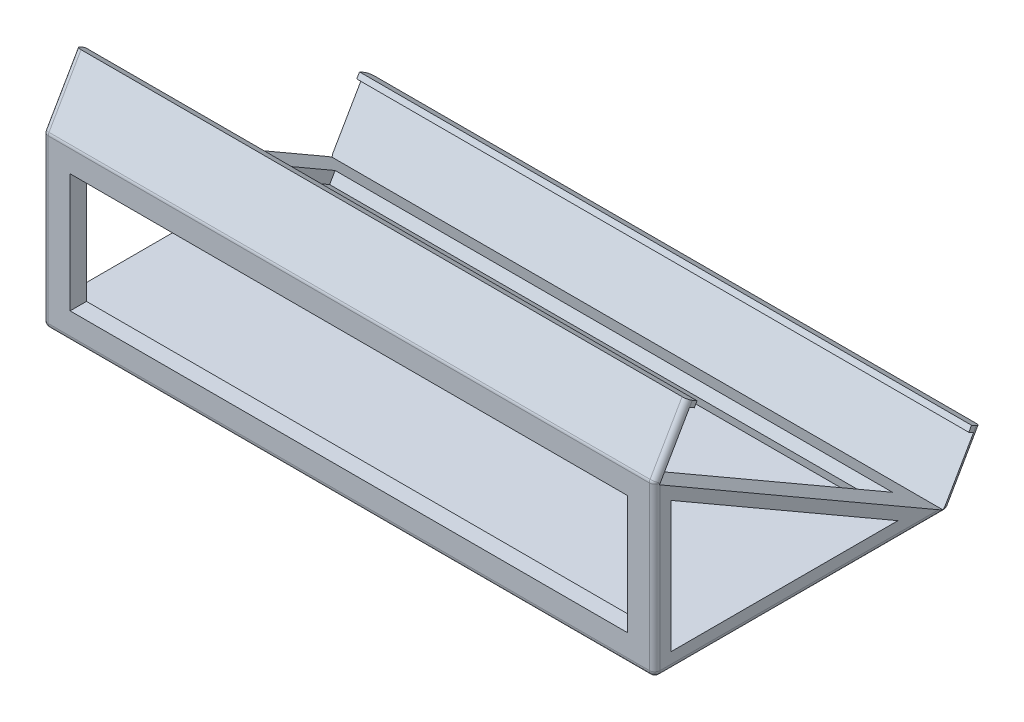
ISO-10303-21;
HEADER;
FILE_DESCRIPTION(('STEP AP214'),'2;1');
FILE_NAME('part.step','',(''),(''),'','','');
FILE_SCHEMA(('AUTOMOTIVE_DESIGN { 1 0 10303 214 1 1 1 1 }'));
ENDSEC;
DATA;
#1=APPLICATION_CONTEXT('core data for automotive mechanical design processes');
#2=APPLICATION_PROTOCOL_DEFINITION('international standard','automotive_design',2000,#1);
#3=PRODUCT_CONTEXT('',#1,'mechanical');
#4=PRODUCT('Part','Part','',(#3));
#5=PRODUCT_RELATED_PRODUCT_CATEGORY('part','',(#4));
#6=PRODUCT_DEFINITION_FORMATION('','',#4);
#7=PRODUCT_DEFINITION_CONTEXT('part definition',#1,'design');
#8=PRODUCT_DEFINITION('design','',#6,#7);
#9=PRODUCT_DEFINITION_SHAPE('','',#8);
#10=(LENGTH_UNIT() NAMED_UNIT(*) SI_UNIT(.MILLI.,.METRE.));
#11=(NAMED_UNIT(*) PLANE_ANGLE_UNIT() SI_UNIT($,.RADIAN.));
#12=(NAMED_UNIT(*) SI_UNIT($,.STERADIAN.) SOLID_ANGLE_UNIT());
#13=UNCERTAINTY_MEASURE_WITH_UNIT(LENGTH_MEASURE(1.E-05),#10,'distance_accuracy_value','');
#14=(GEOMETRIC_REPRESENTATION_CONTEXT(3) GLOBAL_UNCERTAINTY_ASSIGNED_CONTEXT((#13)) GLOBAL_UNIT_ASSIGNED_CONTEXT((#10,
#11,#12)) REPRESENTATION_CONTEXT('',''));
#15=CARTESIAN_POINT('',(0.,0.,0.));
#16=DIRECTION('',(0.,0.,1.));
#17=DIRECTION('',(1.,0.,0.));
#18=AXIS2_PLACEMENT_3D('',#15,#16,#17);
#19=CARTESIAN_POINT('',(112.,0.,0.));
#20=DIRECTION('',(1.,0.,0.));
#21=DIRECTION('',(0.,0.,-1.));
#22=AXIS2_PLACEMENT_3D('',#19,#20,#21);
#23=PLANE('',#22);
#24=DIRECTION('',(0.,-0.500000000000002,-0.866025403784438));
#25=VECTOR('',#24,1.);
#26=CARTESIAN_POINT('',(112.,41.3923048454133,47.6935750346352));
#27=LINE('',#26,#25);
#28=CARTESIAN_POINT('',(112.,40.8923048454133,46.8275496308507));
#29=VERTEX_POINT('',#28);
#30=CARTESIAN_POINT('',(112.,40.3923048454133,45.9615242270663));
#31=VERTEX_POINT('',#30);
#32=EDGE_CURVE('E404',#29,#31,#27,.T.);
#33=ORIENTED_EDGE('',*,*,#32,.F.);
#34=DIRECTION('',(0.,-0.866025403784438,0.500000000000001));
#35=VECTOR('',#34,1.);
#36=CARTESIAN_POINT('',(112.,30.5000000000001,52.8275496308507));
#37=LINE('',#36,#35);
#38=CARTESIAN_POINT('',(112.,40.0262794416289,47.3275496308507));
#39=VERTEX_POINT('',#38);
#40=EDGE_CURVE('E456',#29,#39,#37,.T.);
#41=ORIENTED_EDGE('',*,*,#40,.T.);
#42=DIRECTION('',(0.,0.500000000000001,0.866025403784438));
#43=VECTOR('',#42,1.);
#44=CARTESIAN_POINT('',(112.,39.5262794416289,46.4615242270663));
#45=LINE('',#44,#43);
#46=CARTESIAN_POINT('',(112.,39.5262794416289,46.4615242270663));
#47=VERTEX_POINT('',#46);
#48=EDGE_CURVE('E391',#47,#39,#45,.T.);
#49=ORIENTED_EDGE('',*,*,#48,.F.);
#50=DIRECTION('',(0.,-0.866025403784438,0.500000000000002));
#51=VECTOR('',#50,1.);
#52=CARTESIAN_POINT('',(112.,40.3923048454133,45.9615242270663));
#53=LINE('',#52,#51);
#54=EDGE_CURVE('E375',#31,#47,#53,.T.);
#55=ORIENTED_EDGE('',*,*,#54,.F.);
#56=EDGE_LOOP('',(#33,#41,#49,#55));
#57=FACE_BOUND('',#56,.T.);
#58=ADVANCED_FACE('F35',(#57),#23,.T.);
#59=DIRECTION('',(0.,-0.500000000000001,-0.866025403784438));
#60=VECTOR('',#59,1.);
#61=CARTESIAN_POINT('',(112.,10.5262794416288,-3.76794919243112));
#62=LINE('',#61,#60);
#63=CARTESIAN_POINT('',(112.,10.5262794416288,-3.76794919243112));
#64=VERTEX_POINT('',#63);
#65=CARTESIAN_POINT('',(112.,10.0262794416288,-4.63397459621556));
#66=VERTEX_POINT('',#65);
#67=EDGE_CURVE('E366',#64,#66,#62,.T.);
#68=ORIENTED_EDGE('',*,*,#67,.T.);
#69=DIRECTION('',(0.,-0.866025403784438,0.500000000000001));
#70=VECTOR('',#69,1.);
#71=CARTESIAN_POINT('',(112.,0.500000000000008,0.86602540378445));
#72=LINE('',#71,#70);
#73=CARTESIAN_POINT('',(112.,10.8923048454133,-5.13397459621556));
#74=VERTEX_POINT('',#73);
#75=EDGE_CURVE('E454',#66,#74,#72,.F.);
#76=ORIENTED_EDGE('',*,*,#75,.T.);
#77=DIRECTION('',(0.,0.500000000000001,0.866025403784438));
#78=VECTOR('',#77,1.);
#79=CARTESIAN_POINT('',(112.,10.3923048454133,-6.));
#80=LINE('',#79,#78);
#81=CARTESIAN_POINT('',(112.,11.3923048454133,-4.26794919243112));
#82=VERTEX_POINT('',#81);
#83=EDGE_CURVE('E410',#74,#82,#80,.T.);
#84=ORIENTED_EDGE('',*,*,#83,.T.);
#85=DIRECTION('',(0.,0.866025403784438,-0.500000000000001));
#86=VECTOR('',#85,1.);
#87=CARTESIAN_POINT('',(112.,11.3923048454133,-4.26794919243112));
#88=LINE('',#87,#86);
#89=EDGE_CURVE('E360',#64,#82,#88,.T.);
#90=ORIENTED_EDGE('',*,*,#89,.F.);
#91=EDGE_LOOP('',(#68,#76,#84,#90));
#92=FACE_BOUND('',#91,.T.);
#93=ADVANCED_FACE('F665',(#92),#23,.T.);
#94=CARTESIAN_POINT('',(0.,0.,0.));
#95=DIRECTION('',(1.,0.,0.));
#96=DIRECTION('',(0.,0.,-1.));
#97=AXIS2_PLACEMENT_3D('',#94,#95,#96);
#98=PLANE('',#97);
#99=DIRECTION('',(0.,0.,1.));
#100=VECTOR('',#99,1.);
#101=CARTESIAN_POINT('',(0.,3.,9.19615242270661));
#102=LINE('',#101,#100);
#103=CARTESIAN_POINT('',(0.,3.,9.19615242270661));
#104=VERTEX_POINT('',#103);
#105=CARTESIAN_POINT('',(0.,2.99999999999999,50.6935750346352));
#106=VERTEX_POINT('',#105);
#107=EDGE_CURVE('E340',#104,#106,#102,.T.);
#108=ORIENTED_EDGE('',*,*,#107,.F.);
#109=DIRECTION('',(0.,-0.500000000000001,-0.866025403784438));
#110=VECTOR('',#109,1.);
#111=CARTESIAN_POINT('',(0.,26.9585481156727,50.6935750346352));
#112=LINE('',#111,#110);
#113=CARTESIAN_POINT('',(0.,26.9585481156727,50.6935750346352));
#114=VERTEX_POINT('',#113);
#115=EDGE_CURVE('E326',#114,#104,#112,.T.);
#116=ORIENTED_EDGE('',*,*,#115,.F.);
#117=DIRECTION('',(0.,1.,0.));
#118=VECTOR('',#117,1.);
#119=CARTESIAN_POINT('',(0.,2.99999999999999,50.6935750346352));
#120=LINE('',#119,#118);
#121=EDGE_CURVE('E331',#106,#114,#120,.T.);
#122=ORIENTED_EDGE('',*,*,#121,.F.);
#123=EDGE_LOOP('',(#108,#116,#122));
#124=FACE_BOUND('',#123,.T.);
#125=DIRECTION('',(0.,0.,-1.));
#126=VECTOR('',#125,1.);
#127=CARTESIAN_POINT('',(0.,1.,0.));
#128=LINE('',#127,#126);
#129=CARTESIAN_POINT('',(0.,1.,1.73205080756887));
#130=VERTEX_POINT('',#129);
#131=CARTESIAN_POINT('',(0.,0.999999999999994,52.6935750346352));
#132=VERTEX_POINT('',#131);
#133=EDGE_CURVE('E438',#130,#132,#128,.F.);
#134=ORIENTED_EDGE('',*,*,#133,.T.);
#135=DIRECTION('',(0.,-1.,0.));
#136=VECTOR('',#135,1.);
#137=CARTESIAN_POINT('',(0.,0.,52.6935750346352));
#138=LINE('',#137,#136);
#139=CARTESIAN_POINT('',(0.,30.4226497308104,52.6935750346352));
#140=VERTEX_POINT('',#139);
#141=EDGE_CURVE('E529',#132,#140,#138,.F.);
#142=ORIENTED_EDGE('',*,*,#141,.T.);
#143=DIRECTION('',(0.,0.500000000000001,0.866025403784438));
#144=VECTOR('',#143,1.);
#145=CARTESIAN_POINT('',(0.,0.,0.));
#146=LINE('',#145,#144);
#147=EDGE_CURVE('E424',#130,#140,#146,.T.);
#148=ORIENTED_EDGE('',*,*,#147,.F.);
#149=EDGE_LOOP('',(#134,#142,#148));
#150=FACE_BOUND('',#149,.T.);
#151=ADVANCED_FACE('F612',(#124,#150),#98,.F.);
#152=DIRECTION('',(0.,0.500000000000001,0.866025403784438));
#153=VECTOR('',#152,1.);
#154=CARTESIAN_POINT('',(0.,10.3923048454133,-6.00000000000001));
#155=LINE('',#154,#153);
#156=CARTESIAN_POINT('',(0.,10.8923048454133,-5.13397459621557));
#157=VERTEX_POINT('',#156);
#158=CARTESIAN_POINT('',(0.,11.3923048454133,-4.26794919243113));
#159=VERTEX_POINT('',#158);
#160=EDGE_CURVE('E415',#157,#159,#155,.T.);
#161=ORIENTED_EDGE('',*,*,#160,.F.);
#162=DIRECTION('',(0.,-0.866025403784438,0.500000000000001));
#163=VECTOR('',#162,1.);
#164=CARTESIAN_POINT('',(0.,0.500000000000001,0.866025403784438));
#165=LINE('',#164,#163);
#166=CARTESIAN_POINT('',(0.,10.0262794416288,-4.63397459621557));
#167=VERTEX_POINT('',#166);
#168=EDGE_CURVE('E441',#157,#167,#165,.T.);
#169=ORIENTED_EDGE('',*,*,#168,.T.);
#170=DIRECTION('',(0.,-0.500000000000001,-0.866025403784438));
#171=VECTOR('',#170,1.);
#172=CARTESIAN_POINT('',(0.,10.5262794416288,-3.76794919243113));
#173=LINE('',#172,#171);
#174=CARTESIAN_POINT('',(0.,10.5262794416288,-3.76794919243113));
#175=VERTEX_POINT('',#174);
#176=EDGE_CURVE('E371',#175,#167,#173,.T.);
#177=ORIENTED_EDGE('',*,*,#176,.F.);
#178=DIRECTION('',(0.,-0.866025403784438,0.500000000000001));
#179=VECTOR('',#178,1.);
#180=CARTESIAN_POINT('',(0.,11.3923048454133,-4.26794919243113));
#181=LINE('',#180,#179);
#182=EDGE_CURVE('E354',#159,#175,#181,.T.);
#183=ORIENTED_EDGE('',*,*,#182,.F.);
#184=EDGE_LOOP('',(#161,#169,#177,#183));
#185=FACE_BOUND('',#184,.T.);
#186=ADVANCED_FACE('F655',(#185),#98,.F.);
#187=CARTESIAN_POINT('',(0.,10.8923048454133,-5.13397459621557));
#188=DIRECTION('',(0.,-0.500000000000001,-0.866025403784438));
#189=DIRECTION('',(0.,0.866025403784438,-0.500000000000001));
#190=AXIS2_PLACEMENT_3D('',#187,#188,#189);
#191=PLANE('',#190);
#192=DIRECTION('',(0.,-0.866025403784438,0.500000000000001));
#193=VECTOR('',#192,1.);
#194=CARTESIAN_POINT('',(0.,10.8923048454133,-5.13397459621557));
#195=LINE('',#194,#193);
#196=CARTESIAN_POINT('',(0.,1.,0.577350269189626));
#197=VERTEX_POINT('',#196);
#198=EDGE_CURVE('E417',#167,#197,#195,.T.);
#199=ORIENTED_EDGE('',*,*,#198,.T.);
#200=CARTESIAN_POINT('',(1.,1.,0.577350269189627));
#201=DIRECTION('',(0.,-0.500000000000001,-0.866025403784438));
#202=DIRECTION('',(0.,0.866025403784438,-0.500000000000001));
#203=AXIS2_PLACEMENT_3D('',#200,#201,#202);
#204=ELLIPSE('',#203,1.15470053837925,1.);
#205=CARTESIAN_POINT('',(0.133974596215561,0.500000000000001,0.866025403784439));
#206=VERTEX_POINT('',#205);
#207=EDGE_CURVE('E487',#197,#206,#204,.F.);
#208=ORIENTED_EDGE('',*,*,#207,.T.);
#209=DIRECTION('',(1.,0.,0.));
#210=VECTOR('',#209,1.);
#211=CARTESIAN_POINT('',(0.,0.500000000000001,0.866025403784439));
#212=LINE('',#211,#210);
#213=CARTESIAN_POINT('',(111.866025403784,0.500000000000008,0.86602540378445));
#214=VERTEX_POINT('',#213);
#215=EDGE_CURVE('E403',#206,#214,#212,.T.);
#216=ORIENTED_EDGE('',*,*,#215,.T.);
#217=CARTESIAN_POINT('',(111.,1.,0.577350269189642));
#218=DIRECTION('',(0.,-0.500000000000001,-0.866025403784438));
#219=DIRECTION('',(0.,-0.866025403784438,0.500000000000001));
#220=AXIS2_PLACEMENT_3D('',#217,#218,#219);
#221=ELLIPSE('',#220,1.15470053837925,1.);
#222=CARTESIAN_POINT('',(112.,1.,0.57735026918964));
#223=VERTEX_POINT('',#222);
#224=EDGE_CURVE('E485',#214,#223,#221,.F.);
#225=ORIENTED_EDGE('',*,*,#224,.T.);
#226=DIRECTION('',(0.,-0.866025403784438,0.500000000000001));
#227=VECTOR('',#226,1.);
#228=CARTESIAN_POINT('',(112.,10.8923048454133,-5.13397459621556));
#229=LINE('',#228,#227);
#230=EDGE_CURVE('E421',#66,#223,#229,.T.);
#231=ORIENTED_EDGE('',*,*,#230,.F.);
#232=DIRECTION('',(1.,0.,0.));
#233=VECTOR('',#232,1.);
#234=CARTESIAN_POINT('',(0.,10.0262794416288,-4.63397459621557));
#235=LINE('',#234,#233);
#236=EDGE_CURVE('E358',#167,#66,#235,.T.);
#237=ORIENTED_EDGE('',*,*,#236,.F.);
#238=EDGE_LOOP('',(#199,#208,#216,#225,#231,#237));
#239=FACE_BOUND('',#238,.T.);
#240=ADVANCED_FACE('F575',(#239),#191,.F.);
#241=CARTESIAN_POINT('',(0.,40.8923048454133,46.8275496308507));
#242=DIRECTION('',(0.,-0.500000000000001,-0.866025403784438));
#243=DIRECTION('',(0.,0.866025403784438,-0.500000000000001));
#244=AXIS2_PLACEMENT_3D('',#241,#242,#243);
#245=PLANE('',#244);
#246=DIRECTION('',(1.,0.,0.));
#247=VECTOR('',#246,1.);
#248=CARTESIAN_POINT('',(0.,30.5000000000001,52.8275496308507));
#249=LINE('',#248,#247);
#250=CARTESIAN_POINT('',(0.00901523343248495,30.5000000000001,52.8275496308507));
#251=VERTEX_POINT('',#250);
#252=CARTESIAN_POINT('',(111.990984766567,30.5000000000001,52.8275496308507));
#253=VERTEX_POINT('',#252);
#254=EDGE_CURVE('E401',#251,#253,#249,.T.);
#255=ORIENTED_EDGE('',*,*,#254,.F.);
#256=CARTESIAN_POINT('',(1.,30.732050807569,52.6935750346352));
#257=DIRECTION('',(0.,-0.500000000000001,-0.866025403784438));
#258=DIRECTION('',(0.,-0.866025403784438,0.500000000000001));
#259=AXIS2_PLACEMENT_3D('',#256,#257,#258);
#260=ELLIPSE('',#259,2.,1.);
#261=CARTESIAN_POINT('',(0.,30.732050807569,52.6935750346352));
#262=VERTEX_POINT('',#261);
#263=EDGE_CURVE('E11',#251,#262,#260,.T.);
#264=ORIENTED_EDGE('',*,*,#263,.T.);
#265=DIRECTION('',(0.,-0.866025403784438,0.500000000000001));
#266=VECTOR('',#265,1.);
#267=CARTESIAN_POINT('',(0.,40.8923048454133,46.8275496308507));
#268=LINE('',#267,#266);
#269=CARTESIAN_POINT('',(0.,40.0262794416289,47.3275496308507));
#270=VERTEX_POINT('',#269);
#271=EDGE_CURVE('E394',#270,#262,#268,.T.);
#272=ORIENTED_EDGE('',*,*,#271,.F.);
#273=DIRECTION('',(-1.,0.,0.));
#274=VECTOR('',#273,1.);
#275=CARTESIAN_POINT('',(112.,40.0262794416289,47.3275496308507));
#276=LINE('',#275,#274);
#277=EDGE_CURVE('E374',#39,#270,#276,.T.);
#278=ORIENTED_EDGE('',*,*,#277,.F.);
#279=DIRECTION('',(0.,-0.866025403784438,0.500000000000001));
#280=VECTOR('',#279,1.);
#281=CARTESIAN_POINT('',(112.,40.8923048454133,46.8275496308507));
#282=LINE('',#281,#280);
#283=CARTESIAN_POINT('',(112.,30.7320508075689,52.6935750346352));
#284=VERTEX_POINT('',#283);
#285=EDGE_CURVE('E395',#39,#284,#282,.T.);
#286=ORIENTED_EDGE('',*,*,#285,.T.);
#287=CARTESIAN_POINT('',(111.,30.732050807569,52.6935750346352));
#288=DIRECTION('',(0.,-0.500000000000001,-0.866025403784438));
#289=DIRECTION('',(0.,0.866025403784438,-0.500000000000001));
#290=AXIS2_PLACEMENT_3D('',#287,#288,#289);
#291=ELLIPSE('',#290,2.,1.);
#292=EDGE_CURVE('E459',#284,#253,#291,.T.);
#293=ORIENTED_EDGE('',*,*,#292,.T.);
#294=EDGE_LOOP('',(#255,#264,#272,#278,#286,#293));
#295=FACE_BOUND('',#294,.T.);
#296=ADVANCED_FACE('F615',(#295),#245,.T.);
#297=CARTESIAN_POINT('',(112.,0.,0.));
#298=DIRECTION('',(0.,-0.866025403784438,0.500000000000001));
#299=DIRECTION('',(0.,-0.500000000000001,-0.866025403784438));
#300=AXIS2_PLACEMENT_3D('',#297,#298,#299);
#301=PLANE('',#300);
#302=DIRECTION('',(0.,0.500000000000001,0.866025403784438));
#303=VECTOR('',#302,1.);
#304=CARTESIAN_POINT('',(5.,3.00000000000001,5.19615242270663));
#305=LINE('',#304,#303);
#306=CARTESIAN_POINT('',(5.,3.00000000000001,5.19615242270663));
#307=VERTEX_POINT('',#306);
#308=CARTESIAN_POINT('',(5.,28.0000000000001,48.4974226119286));
#309=VERTEX_POINT('',#308);
#310=EDGE_CURVE('E277',#307,#309,#305,.T.);
#311=ORIENTED_EDGE('',*,*,#310,.F.);
#312=DIRECTION('',(-1.,0.,0.));
#313=VECTOR('',#312,1.);
#314=CARTESIAN_POINT('',(107.,3.00000000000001,5.19615242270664));
#315=LINE('',#314,#313);
#316=CARTESIAN_POINT('',(107.,3.00000000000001,5.19615242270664));
#317=VERTEX_POINT('',#316);
#318=EDGE_CURVE('E52',#317,#307,#315,.T.);
#319=ORIENTED_EDGE('',*,*,#318,.F.);
#320=DIRECTION('',(0.,-0.500000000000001,-0.866025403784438));
#321=VECTOR('',#320,1.);
#322=CARTESIAN_POINT('',(107.,28.0000000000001,48.4974226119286));
#323=LINE('',#322,#321);
#324=CARTESIAN_POINT('',(107.,28.0000000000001,48.4974226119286));
#325=VERTEX_POINT('',#324);
#326=EDGE_CURVE('E284',#325,#317,#323,.T.);
#327=ORIENTED_EDGE('',*,*,#326,.F.);
#328=DIRECTION('',(1.,0.,0.));
#329=VECTOR('',#328,1.);
#330=CARTESIAN_POINT('',(5.,28.0000000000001,48.4974226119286));
#331=LINE('',#330,#329);
#332=EDGE_CURVE('E269',#309,#325,#331,.T.);
#333=ORIENTED_EDGE('',*,*,#332,.F.);
#334=EDGE_LOOP('',(#311,#319,#327,#333));
#335=FACE_BOUND('',#334,.T.);
#336=ORIENTED_EDGE('',*,*,#147,.T.);
#337=CARTESIAN_POINT('',(1.,30.4226497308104,52.6935750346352));
#338=DIRECTION('',(0.,-0.866025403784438,0.500000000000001));
#339=DIRECTION('',(0.,-0.500000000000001,-0.866025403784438));
#340=AXIS2_PLACEMENT_3D('',#337,#338,#339);
#341=ELLIPSE('',#340,1.15470053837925,1.);
#342=EDGE_CURVE('E44',#140,#251,#341,.F.);
#343=ORIENTED_EDGE('',*,*,#342,.T.);
#344=ORIENTED_EDGE('',*,*,#254,.T.);
#345=CARTESIAN_POINT('',(111.,30.4226497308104,52.6935750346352));
#346=DIRECTION('',(0.,-0.866025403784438,0.500000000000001));
#347=DIRECTION('',(0.,0.500000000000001,0.866025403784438));
#348=AXIS2_PLACEMENT_3D('',#345,#346,#347);
#349=ELLIPSE('',#348,1.15470053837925,1.);
#350=CARTESIAN_POINT('',(112.,30.4226497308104,52.6935750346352));
#351=VERTEX_POINT('',#350);
#352=EDGE_CURVE('E466',#253,#351,#349,.F.);
#353=ORIENTED_EDGE('',*,*,#352,.T.);
#354=DIRECTION('',(0.,0.500000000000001,0.866025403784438));
#355=VECTOR('',#354,1.);
#356=CARTESIAN_POINT('',(112.,0.,0.));
#357=LINE('',#356,#355);
#358=CARTESIAN_POINT('',(112.,1.,1.73205080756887));
#359=VERTEX_POINT('',#358);
#360=EDGE_CURVE('E425',#359,#351,#357,.T.);
#361=ORIENTED_EDGE('',*,*,#360,.F.);
#362=CARTESIAN_POINT('',(111.,1.,1.73205080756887));
#363=DIRECTION('',(0.,-0.866025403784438,0.500000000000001));
#364=DIRECTION('',(0.,0.500000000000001,0.866025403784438));
#365=AXIS2_PLACEMENT_3D('',#362,#363,#364);
#366=ELLIPSE('',#365,2.,1.);
#367=EDGE_CURVE('E462',#359,#214,#366,.F.);
#368=ORIENTED_EDGE('',*,*,#367,.T.);
#369=ORIENTED_EDGE('',*,*,#215,.F.);
#370=CARTESIAN_POINT('',(1.,1.,1.73205080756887));
#371=DIRECTION('',(0.,-0.866025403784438,0.500000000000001));
#372=DIRECTION('',(0.,-0.500000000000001,-0.866025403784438));
#373=AXIS2_PLACEMENT_3D('',#370,#371,#372);
#374=ELLIPSE('',#373,2.,1.);
#375=EDGE_CURVE('E464',#206,#130,#374,.F.);
#376=ORIENTED_EDGE('',*,*,#375,.T.);
#377=EDGE_LOOP('',(#336,#343,#344,#353,#361,#368,#369,#376));
#378=FACE_BOUND('',#377,.T.);
#379=ADVANCED_FACE('F281',(#335,#378),#301,.F.);
#380=CARTESIAN_POINT('',(112.,31.0000000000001,53.6935750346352));
#381=DIRECTION('',(0.,0.,-1.));
#382=DIRECTION('',(-1.,0.,0.));
#383=AXIS2_PLACEMENT_3D('',#380,#381,#382);
#384=PLANE('',#383);
#385=DIRECTION('',(-1.,0.,0.));
#386=VECTOR('',#385,1.);
#387=CARTESIAN_POINT('',(107.,26.732050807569,53.6935750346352));
#388=LINE('',#387,#386);
#389=CARTESIAN_POINT('',(107.,26.732050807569,53.6935750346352));
#390=VERTEX_POINT('',#389);
#391=CARTESIAN_POINT('',(5.,26.732050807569,53.6935750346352));
#392=VERTEX_POINT('',#391);
#393=EDGE_CURVE('E301',#390,#392,#388,.T.);
#394=ORIENTED_EDGE('',*,*,#393,.F.);
#395=DIRECTION('',(0.,1.,0.));
#396=VECTOR('',#395,1.);
#397=CARTESIAN_POINT('',(107.,4.99999999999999,53.6935750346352));
#398=LINE('',#397,#396);
#399=CARTESIAN_POINT('',(107.,4.99999999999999,53.6935750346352));
#400=VERTEX_POINT('',#399);
#401=EDGE_CURVE('E304',#400,#390,#398,.T.);
#402=ORIENTED_EDGE('',*,*,#401,.F.);
#403=DIRECTION('',(1.,0.,0.));
#404=VECTOR('',#403,1.);
#405=CARTESIAN_POINT('',(5.,4.99999999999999,53.6935750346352));
#406=LINE('',#405,#404);
#407=CARTESIAN_POINT('',(5.,4.99999999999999,53.6935750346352));
#408=VERTEX_POINT('',#407);
#409=EDGE_CURVE('E307',#408,#400,#406,.T.);
#410=ORIENTED_EDGE('',*,*,#409,.F.);
#411=DIRECTION('',(0.,-1.,0.));
#412=VECTOR('',#411,1.);
#413=CARTESIAN_POINT('',(5.,26.732050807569,53.6935750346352));
#414=LINE('',#413,#412);
#415=EDGE_CURVE('E298',#392,#408,#414,.T.);
#416=ORIENTED_EDGE('',*,*,#415,.F.);
#417=EDGE_LOOP('',(#394,#402,#410,#416));
#418=FACE_BOUND('',#417,.T.);
#419=DIRECTION('',(0.,-1.,0.));
#420=VECTOR('',#419,1.);
#421=CARTESIAN_POINT('',(111.,31.0000000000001,53.6935750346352));
#422=LINE('',#421,#420);
#423=CARTESIAN_POINT('',(111.,0.999999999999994,53.6935750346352));
#424=VERTEX_POINT('',#423);
#425=CARTESIAN_POINT('',(111.,30.732050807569,53.6935750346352));
#426=VERTEX_POINT('',#425);
#427=EDGE_CURVE('E435',#424,#426,#422,.F.);
#428=ORIENTED_EDGE('',*,*,#427,.T.);
#429=DIRECTION('',(-1.,0.,0.));
#430=VECTOR('',#429,1.);
#431=CARTESIAN_POINT('',(112.,30.732050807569,53.6935750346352));
#432=LINE('',#431,#430);
#433=CARTESIAN_POINT('',(1.,30.732050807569,53.6935750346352));
#434=VERTEX_POINT('',#433);
#435=EDGE_CURVE('E517',#426,#434,#432,.T.);
#436=ORIENTED_EDGE('',*,*,#435,.T.);
#437=DIRECTION('',(0.,-1.,0.));
#438=VECTOR('',#437,1.);
#439=CARTESIAN_POINT('',(1.,31.0000000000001,53.6935750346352));
#440=LINE('',#439,#438);
#441=CARTESIAN_POINT('',(1.,0.999999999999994,53.6935750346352));
#442=VERTEX_POINT('',#441);
#443=EDGE_CURVE('E513',#434,#442,#440,.T.);
#444=ORIENTED_EDGE('',*,*,#443,.T.);
#445=DIRECTION('',(-1.,0.,0.));
#446=VECTOR('',#445,1.);
#447=CARTESIAN_POINT('',(112.,0.999999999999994,53.6935750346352));
#448=LINE('',#447,#446);
#449=EDGE_CURVE('E515',#442,#424,#448,.F.);
#450=ORIENTED_EDGE('',*,*,#449,.T.);
#451=EDGE_LOOP('',(#428,#436,#444,#450));
#452=FACE_BOUND('',#451,.T.);
#453=ADVANCED_FACE('F1090',(#418,#452),#384,.F.);
#454=CARTESIAN_POINT('',(112.,0.,0.));
#455=DIRECTION('',(0.,1.,0.));
#456=DIRECTION('',(0.,0.,1.));
#457=AXIS2_PLACEMENT_3D('',#454,#455,#456);
#458=PLANE('',#457);
#459=DIRECTION('',(0.,0.,-1.));
#460=VECTOR('',#459,1.);
#461=CARTESIAN_POINT('',(111.,0.,0.));
#462=LINE('',#461,#460);
#463=CARTESIAN_POINT('',(111.,0.,0.577350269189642));
#464=VERTEX_POINT('',#463);
#465=CARTESIAN_POINT('',(111.,0.,52.6935750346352));
#466=VERTEX_POINT('',#465);
#467=EDGE_CURVE('E478',#464,#466,#462,.F.);
#468=ORIENTED_EDGE('',*,*,#467,.T.);
#469=DIRECTION('',(-1.,0.,0.));
#470=VECTOR('',#469,1.);
#471=CARTESIAN_POINT('',(112.,0.,52.6935750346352));
#472=LINE('',#471,#470);
#473=CARTESIAN_POINT('',(1.,0.,52.6935750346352));
#474=VERTEX_POINT('',#473);
#475=EDGE_CURVE('E525',#466,#474,#472,.T.);
#476=ORIENTED_EDGE('',*,*,#475,.T.);
#477=DIRECTION('',(0.,0.,-1.));
#478=VECTOR('',#477,1.);
#479=CARTESIAN_POINT('',(1.,0.,0.));
#480=LINE('',#479,#478);
#481=CARTESIAN_POINT('',(1.,0.,0.577350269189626));
#482=VERTEX_POINT('',#481);
#483=EDGE_CURVE('E483',#474,#482,#480,.T.);
#484=ORIENTED_EDGE('',*,*,#483,.T.);
#485=DIRECTION('',(-1.,0.,0.));
#486=VECTOR('',#485,1.);
#487=CARTESIAN_POINT('',(112.,0.,0.577350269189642));
#488=LINE('',#487,#486);
#489=EDGE_CURVE('E481',#482,#464,#488,.F.);
#490=ORIENTED_EDGE('',*,*,#489,.T.);
#491=EDGE_LOOP('',(#468,#476,#484,#490));
#492=FACE_BOUND('',#491,.T.);
#493=ADVANCED_FACE('F601',(#492),#458,.F.);
#494=DIRECTION('',(0.,-0.500000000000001,-0.866025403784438));
#495=VECTOR('',#494,1.);
#496=CARTESIAN_POINT('',(112.,26.9585481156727,50.6935750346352));
#497=LINE('',#496,#495);
#498=CARTESIAN_POINT('',(112.,26.9585481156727,50.6935750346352));
#499=VERTEX_POINT('',#498);
#500=CARTESIAN_POINT('',(112.,3.,9.19615242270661));
#501=VERTEX_POINT('',#500);
#502=EDGE_CURVE('E327',#499,#501,#497,.T.);
#503=ORIENTED_EDGE('',*,*,#502,.T.);
#504=DIRECTION('',(0.,0.,1.));
#505=VECTOR('',#504,1.);
#506=CARTESIAN_POINT('',(112.,3.,9.19615242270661));
#507=LINE('',#506,#505);
#508=CARTESIAN_POINT('',(112.,2.99999999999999,50.6935750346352));
#509=VERTEX_POINT('',#508);
#510=EDGE_CURVE('E330',#501,#509,#507,.T.);
#511=ORIENTED_EDGE('',*,*,#510,.T.);
#512=DIRECTION('',(0.,1.,0.));
#513=VECTOR('',#512,1.);
#514=CARTESIAN_POINT('',(112.,2.99999999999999,50.6935750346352));
#515=LINE('',#514,#513);
#516=EDGE_CURVE('E334',#509,#499,#515,.T.);
#517=ORIENTED_EDGE('',*,*,#516,.T.);
#518=EDGE_LOOP('',(#503,#511,#517));
#519=FACE_BOUND('',#518,.T.);
#520=ORIENTED_EDGE('',*,*,#360,.T.);
#521=DIRECTION('',(0.,-1.,0.));
#522=VECTOR('',#521,1.);
#523=CARTESIAN_POINT('',(112.,0.,52.6935750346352));
#524=LINE('',#523,#522);
#525=CARTESIAN_POINT('',(112.,0.999999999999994,52.6935750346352));
#526=VERTEX_POINT('',#525);
#527=EDGE_CURVE('E451',#351,#526,#524,.T.);
#528=ORIENTED_EDGE('',*,*,#527,.T.);
#529=DIRECTION('',(0.,0.,-1.));
#530=VECTOR('',#529,1.);
#531=CARTESIAN_POINT('',(112.,1.,0.));
#532=LINE('',#531,#530);
#533=EDGE_CURVE('E449',#526,#359,#532,.T.);
#534=ORIENTED_EDGE('',*,*,#533,.T.);
#535=EDGE_LOOP('',(#520,#528,#534));
#536=FACE_BOUND('',#535,.T.);
#537=ADVANCED_FACE('F565',(#519,#536),#23,.T.);
#538=DIRECTION('',(0.,0.500000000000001,0.866025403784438));
#539=VECTOR('',#538,1.);
#540=CARTESIAN_POINT('',(0.,39.5262794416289,46.4615242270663));
#541=LINE('',#540,#539);
#542=CARTESIAN_POINT('',(0.,39.5262794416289,46.4615242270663));
#543=VERTEX_POINT('',#542);
#544=EDGE_CURVE('E386',#543,#270,#541,.T.);
#545=ORIENTED_EDGE('',*,*,#544,.T.);
#546=DIRECTION('',(0.,-0.866025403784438,0.500000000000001));
#547=VECTOR('',#546,1.);
#548=CARTESIAN_POINT('',(0.,30.5,52.8275496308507));
#549=LINE('',#548,#547);
#550=CARTESIAN_POINT('',(0.,40.8923048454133,46.8275496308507));
#551=VERTEX_POINT('',#550);
#552=EDGE_CURVE('E443',#270,#551,#549,.F.);
#553=ORIENTED_EDGE('',*,*,#552,.T.);
#554=DIRECTION('',(0.,-0.500000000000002,-0.866025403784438));
#555=VECTOR('',#554,1.);
#556=CARTESIAN_POINT('',(0.,41.3923048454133,47.6935750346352));
#557=LINE('',#556,#555);
#558=CARTESIAN_POINT('',(0.,40.3923048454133,45.9615242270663));
#559=VERTEX_POINT('',#558);
#560=EDGE_CURVE('E398',#551,#559,#557,.T.);
#561=ORIENTED_EDGE('',*,*,#560,.T.);
#562=DIRECTION('',(0.,0.866025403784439,-0.499999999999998));
#563=VECTOR('',#562,1.);
#564=CARTESIAN_POINT('',(0.,40.3923048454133,45.9615242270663));
#565=LINE('',#564,#563);
#566=EDGE_CURVE('E380',#543,#559,#565,.T.);
#567=ORIENTED_EDGE('',*,*,#566,.F.);
#568=EDGE_LOOP('',(#545,#553,#561,#567));
#569=FACE_BOUND('',#568,.T.);
#570=ADVANCED_FACE('F651',(#569),#98,.F.);
#571=CARTESIAN_POINT('',(0.,10.3923048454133,-6.00000000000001));
#572=DIRECTION('',(0.,-0.500000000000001,-0.866025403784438));
#573=DIRECTION('',(0.,0.866025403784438,-0.500000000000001));
#574=AXIS2_PLACEMENT_3D('',#571,#572,#573);
#575=PLANE('',#574);
#576=DIRECTION('',(1.,0.,0.));
#577=VECTOR('',#576,1.);
#578=CARTESIAN_POINT('',(0.,10.3923048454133,-6.00000000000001));
#579=LINE('',#578,#577);
#580=CARTESIAN_POINT('',(1.,10.3923048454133,-6.00000000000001));
#581=VERTEX_POINT('',#580);
#582=CARTESIAN_POINT('',(111.,10.3923048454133,-6.));
#583=VERTEX_POINT('',#582);
#584=EDGE_CURVE('E412',#581,#583,#579,.T.);
#585=ORIENTED_EDGE('',*,*,#584,.T.);
#586=DIRECTION('',(0.,-0.866025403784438,0.500000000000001));
#587=VECTOR('',#586,1.);
#588=CARTESIAN_POINT('',(111.,10.3923048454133,-6.));
#589=LINE('',#588,#587);
#590=CARTESIAN_POINT('',(111.,0.499999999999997,-0.288675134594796));
#591=VERTEX_POINT('',#590);
#592=EDGE_CURVE('E472',#583,#591,#589,.T.);
#593=ORIENTED_EDGE('',*,*,#592,.T.);
#594=DIRECTION('',(-1.,0.,0.));
#595=VECTOR('',#594,1.);
#596=CARTESIAN_POINT('',(0.,0.499999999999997,-0.288675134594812));
#597=LINE('',#596,#595);
#598=CARTESIAN_POINT('',(1.,0.499999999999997,-0.288675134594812));
#599=VERTEX_POINT('',#598);
#600=EDGE_CURVE('E470',#591,#599,#597,.T.);
#601=ORIENTED_EDGE('',*,*,#600,.T.);
#602=DIRECTION('',(0.,-0.866025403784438,0.500000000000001));
#603=VECTOR('',#602,1.);
#604=CARTESIAN_POINT('',(1.,10.3923048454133,-6.00000000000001));
#605=LINE('',#604,#603);
#606=EDGE_CURVE('E468',#599,#581,#605,.F.);
#607=ORIENTED_EDGE('',*,*,#606,.T.);
#608=EDGE_LOOP('',(#585,#593,#601,#607));
#609=FACE_BOUND('',#608,.T.);
#610=ADVANCED_FACE('F653',(#609),#575,.T.);
#611=CARTESIAN_POINT('',(0.,10.3923048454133,-6.00000000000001));
#612=DIRECTION('',(0.,-0.866025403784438,0.500000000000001));
#613=DIRECTION('',(0.,-0.500000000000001,-0.866025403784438));
#614=AXIS2_PLACEMENT_3D('',#611,#612,#613);
#615=PLANE('',#614);
#616=ORIENTED_EDGE('',*,*,#83,.F.);
#617=CARTESIAN_POINT('',(111.,10.8923048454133,-5.13397459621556));
#618=DIRECTION('',(0.,-0.866025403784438,0.500000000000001));
#619=DIRECTION('',(0.,-0.500000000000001,-0.866025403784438));
#620=AXIS2_PLACEMENT_3D('',#617,#618,#619);
#621=CIRCLE('',#620,1.);
#622=EDGE_CURVE('E476',#74,#583,#621,.F.);
#623=ORIENTED_EDGE('',*,*,#622,.T.);
#624=ORIENTED_EDGE('',*,*,#584,.F.);
#625=CARTESIAN_POINT('',(1.,10.8923048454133,-5.13397459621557));
#626=DIRECTION('',(0.,-0.866025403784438,0.500000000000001));
#627=DIRECTION('',(0.,-0.500000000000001,-0.866025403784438));
#628=AXIS2_PLACEMENT_3D('',#625,#626,#627);
#629=CIRCLE('',#628,1.);
#630=EDGE_CURVE('E474',#581,#157,#629,.F.);
#631=ORIENTED_EDGE('',*,*,#630,.T.);
#632=ORIENTED_EDGE('',*,*,#160,.T.);
#633=DIRECTION('',(-1.,0.,0.));
#634=VECTOR('',#633,1.);
#635=CARTESIAN_POINT('',(0.,11.3923048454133,-4.26794919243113));
#636=LINE('',#635,#634);
#637=EDGE_CURVE('E363',#82,#159,#636,.T.);
#638=ORIENTED_EDGE('',*,*,#637,.F.);
#639=EDGE_LOOP('',(#616,#623,#624,#631,#632,#638));
#640=FACE_BOUND('',#639,.T.);
#641=ADVANCED_FACE('F660',(#640),#615,.F.);
#642=CARTESIAN_POINT('',(0.,41.3923048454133,47.6935750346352));
#643=DIRECTION('',(0.,-0.500000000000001,-0.866025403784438));
#644=DIRECTION('',(0.,0.866025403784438,-0.500000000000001));
#645=AXIS2_PLACEMENT_3D('',#642,#643,#644);
#646=PLANE('',#645);
#647=DIRECTION('',(0.,-0.866025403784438,0.500000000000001));
#648=VECTOR('',#647,1.);
#649=CARTESIAN_POINT('',(1.,41.3923048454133,47.6935750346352));
#650=LINE('',#649,#648);
#651=CARTESIAN_POINT('',(1.,41.3923048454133,47.6935750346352));
#652=VERTEX_POINT('',#651);
#653=CARTESIAN_POINT('',(1.,31.232050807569,53.5596004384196));
#654=VERTEX_POINT('',#653);
#655=EDGE_CURVE('E432',#652,#654,#650,.T.);
#656=ORIENTED_EDGE('',*,*,#655,.T.);
#657=DIRECTION('',(-1.,0.,0.));
#658=VECTOR('',#657,1.);
#659=CARTESIAN_POINT('',(0.,31.232050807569,53.5596004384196));
#660=LINE('',#659,#658);
#661=CARTESIAN_POINT('',(111.,31.232050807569,53.5596004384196));
#662=VERTEX_POINT('',#661);
#663=EDGE_CURVE('E519',#654,#662,#660,.F.);
#664=ORIENTED_EDGE('',*,*,#663,.T.);
#665=DIRECTION('',(0.,-0.866025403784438,0.500000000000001));
#666=VECTOR('',#665,1.);
#667=CARTESIAN_POINT('',(111.,41.3923048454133,47.6935750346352));
#668=LINE('',#667,#666);
#669=CARTESIAN_POINT('',(111.,41.3923048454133,47.6935750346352));
#670=VERTEX_POINT('',#669);
#671=EDGE_CURVE('E428',#662,#670,#668,.F.);
#672=ORIENTED_EDGE('',*,*,#671,.T.);
#673=DIRECTION('',(1.,0.,0.));
#674=VECTOR('',#673,1.);
#675=CARTESIAN_POINT('',(0.,41.3923048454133,47.6935750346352));
#676=LINE('',#675,#674);
#677=EDGE_CURVE('E406',#652,#670,#676,.T.);
#678=ORIENTED_EDGE('',*,*,#677,.F.);
#679=EDGE_LOOP('',(#656,#664,#672,#678));
#680=FACE_BOUND('',#679,.T.);
#681=ADVANCED_FACE('F628',(#680),#646,.F.);
#682=CARTESIAN_POINT('',(0.,10.3923048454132,-5.99999999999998));
#683=DIRECTION('',(0.,0.866025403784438,-0.500000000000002));
#684=DIRECTION('',(0.,0.500000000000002,0.866025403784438));
#685=AXIS2_PLACEMENT_3D('',#682,#683,#684);
#686=PLANE('',#685);
#687=ORIENTED_EDGE('',*,*,#560,.F.);
#688=CARTESIAN_POINT('',(1.,40.8923048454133,46.8275496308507));
#689=DIRECTION('',(0.,0.866025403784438,-0.500000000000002));
#690=DIRECTION('',(0.,0.500000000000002,0.866025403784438));
#691=AXIS2_PLACEMENT_3D('',#688,#689,#690);
#692=CIRCLE('',#691,1.);
#693=EDGE_CURVE('E447',#551,#652,#692,.T.);
#694=ORIENTED_EDGE('',*,*,#693,.T.);
#695=ORIENTED_EDGE('',*,*,#677,.T.);
#696=CARTESIAN_POINT('',(111.,40.8923048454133,46.8275496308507));
#697=DIRECTION('',(0.,0.866025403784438,-0.500000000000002));
#698=DIRECTION('',(0.,0.500000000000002,0.866025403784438));
#699=AXIS2_PLACEMENT_3D('',#696,#697,#698);
#700=CIRCLE('',#699,1.);
#701=EDGE_CURVE('E445',#670,#29,#700,.T.);
#702=ORIENTED_EDGE('',*,*,#701,.T.);
#703=ORIENTED_EDGE('',*,*,#32,.T.);
#704=DIRECTION('',(1.,0.,0.));
#705=VECTOR('',#704,1.);
#706=CARTESIAN_POINT('',(112.,40.3923048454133,45.9615242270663));
#707=LINE('',#706,#705);
#708=EDGE_CURVE('E383',#559,#31,#707,.T.);
#709=ORIENTED_EDGE('',*,*,#708,.F.);
#710=EDGE_LOOP('',(#687,#694,#695,#702,#703,#709));
#711=FACE_BOUND('',#710,.T.);
#712=ADVANCED_FACE('F633',(#711),#686,.T.);
#713=CARTESIAN_POINT('',(112.,39.5262794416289,46.4615242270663));
#714=DIRECTION('',(0.,0.866025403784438,-0.500000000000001));
#715=DIRECTION('',(0.,0.500000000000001,0.866025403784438));
#716=AXIS2_PLACEMENT_3D('',#713,#714,#715);
#717=PLANE('',#716);
#718=ORIENTED_EDGE('',*,*,#277,.T.);
#719=ORIENTED_EDGE('',*,*,#544,.F.);
#720=DIRECTION('',(-1.,0.,0.));
#721=VECTOR('',#720,1.);
#722=CARTESIAN_POINT('',(112.,39.5262794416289,46.4615242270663));
#723=LINE('',#722,#721);
#724=EDGE_CURVE('E378',#47,#543,#723,.T.);
#725=ORIENTED_EDGE('',*,*,#724,.F.);
#726=ORIENTED_EDGE('',*,*,#48,.T.);
#727=EDGE_LOOP('',(#718,#719,#725,#726));
#728=FACE_BOUND('',#727,.T.);
#729=ADVANCED_FACE('F645',(#728),#717,.F.);
#730=CARTESIAN_POINT('',(0.,30.0000000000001,51.9615242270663));
#731=DIRECTION('',(0.,-0.500000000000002,-0.866025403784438));
#732=DIRECTION('',(0.,0.866025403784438,-0.500000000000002));
#733=AXIS2_PLACEMENT_3D('',#730,#731,#732);
#734=PLANE('',#733);
#735=ORIENTED_EDGE('',*,*,#54,.T.);
#736=ORIENTED_EDGE('',*,*,#724,.T.);
#737=ORIENTED_EDGE('',*,*,#566,.T.);
#738=ORIENTED_EDGE('',*,*,#708,.T.);
#739=EDGE_LOOP('',(#735,#736,#737,#738));
#740=FACE_BOUND('',#739,.T.);
#741=ADVANCED_FACE('F648',(#740),#734,.T.);
#742=CARTESIAN_POINT('',(0.,10.5262794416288,-3.76794919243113));
#743=DIRECTION('',(0.,0.866025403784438,-0.500000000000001));
#744=DIRECTION('',(0.,0.500000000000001,0.866025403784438));
#745=AXIS2_PLACEMENT_3D('',#742,#743,#744);
#746=PLANE('',#745);
#747=ORIENTED_EDGE('',*,*,#236,.T.);
#748=ORIENTED_EDGE('',*,*,#67,.F.);
#749=DIRECTION('',(1.,0.,0.));
#750=VECTOR('',#749,1.);
#751=CARTESIAN_POINT('',(0.,10.5262794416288,-3.76794919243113));
#752=LINE('',#751,#750);
#753=EDGE_CURVE('E357',#175,#64,#752,.T.);
#754=ORIENTED_EDGE('',*,*,#753,.F.);
#755=ORIENTED_EDGE('',*,*,#176,.T.);
#756=EDGE_LOOP('',(#747,#748,#754,#755));
#757=FACE_BOUND('',#756,.T.);
#758=ADVANCED_FACE('F692',(#757),#746,.F.);
#759=CARTESIAN_POINT('',(0.,1.,1.73205080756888));
#760=DIRECTION('',(0.,0.500000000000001,0.866025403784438));
#761=DIRECTION('',(0.,-0.866025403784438,0.500000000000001));
#762=AXIS2_PLACEMENT_3D('',#759,#760,#761);
#763=PLANE('',#762);
#764=ORIENTED_EDGE('',*,*,#182,.T.);
#765=ORIENTED_EDGE('',*,*,#753,.T.);
#766=ORIENTED_EDGE('',*,*,#89,.T.);
#767=ORIENTED_EDGE('',*,*,#637,.T.);
#768=EDGE_LOOP('',(#764,#765,#766,#767));
#769=FACE_BOUND('',#768,.T.);
#770=ADVANCED_FACE('F695',(#769),#763,.T.);
#771=CARTESIAN_POINT('',(1.,40.8923048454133,46.8275496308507));
#772=DIRECTION('',(0.,-0.866025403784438,0.500000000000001));
#773=DIRECTION('',(0.,-0.500000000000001,-0.866025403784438));
#774=AXIS2_PLACEMENT_3D('',#771,#772,#773);
#775=CYLINDRICAL_SURFACE('',#774,1.);
#776=ORIENTED_EDGE('',*,*,#271,.T.);
#777=CARTESIAN_POINT('',(1.,30.732050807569,52.6935750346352));
#778=DIRECTION('',(0.,-0.866025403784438,0.500000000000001));
#779=DIRECTION('',(0.,-0.500000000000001,-0.866025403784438));
#780=AXIS2_PLACEMENT_3D('',#777,#778,#779);
#781=CIRCLE('',#780,1.);
#782=EDGE_CURVE('E521',#262,#654,#781,.F.);
#783=ORIENTED_EDGE('',*,*,#782,.T.);
#784=ORIENTED_EDGE('',*,*,#655,.F.);
#785=ORIENTED_EDGE('',*,*,#693,.F.);
#786=ORIENTED_EDGE('',*,*,#552,.F.);
#787=EDGE_LOOP('',(#776,#783,#784,#785,#786));
#788=FACE_BOUND('',#787,.T.);
#789=ADVANCED_FACE('F623',(#788),#775,.T.);
#790=CARTESIAN_POINT('',(1.,0.500000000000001,0.866025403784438));
#791=DIRECTION('',(0.,0.866025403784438,-0.500000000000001));
#792=DIRECTION('',(0.,0.500000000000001,0.866025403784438));
#793=AXIS2_PLACEMENT_3D('',#790,#791,#792);
#794=CYLINDRICAL_SURFACE('',#793,1.);
#795=ORIENTED_EDGE('',*,*,#630,.F.);
#796=ORIENTED_EDGE('',*,*,#606,.F.);
#797=CARTESIAN_POINT('',(1.,1.,0.577350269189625));
#798=DIRECTION('',(0.,-0.866025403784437,0.500000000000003));
#799=DIRECTION('',(0.,-0.500000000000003,-0.866025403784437));
#800=AXIS2_PLACEMENT_3D('',#797,#798,#799);
#801=CIRCLE('',#800,1.);
#802=EDGE_CURVE('E368',#197,#599,#801,.T.);
#803=ORIENTED_EDGE('',*,*,#802,.F.);
#804=ORIENTED_EDGE('',*,*,#198,.F.);
#805=ORIENTED_EDGE('',*,*,#168,.F.);
#806=EDGE_LOOP('',(#795,#796,#803,#804,#805));
#807=FACE_BOUND('',#806,.T.);
#808=ADVANCED_FACE('F590',(#807),#794,.T.);
#809=CARTESIAN_POINT('',(1.,1.,0.));
#810=DIRECTION('',(0.,0.,-1.));
#811=DIRECTION('',(0.,1.,0.));
#812=AXIS2_PLACEMENT_3D('',#809,#810,#811);
#813=CYLINDRICAL_SURFACE('',#812,1.);
#814=ORIENTED_EDGE('',*,*,#483,.F.);
#815=CARTESIAN_POINT('',(1.,0.999999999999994,52.6935750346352));
#816=DIRECTION('',(0.,0.,-1.));
#817=DIRECTION('',(0.,1.,0.));
#818=AXIS2_PLACEMENT_3D('',#815,#816,#817);
#819=CIRCLE('',#818,1.);
#820=EDGE_CURVE('E527',#474,#132,#819,.T.);
#821=ORIENTED_EDGE('',*,*,#820,.T.);
#822=ORIENTED_EDGE('',*,*,#133,.F.);
#823=ORIENTED_EDGE('',*,*,#375,.F.);
#824=ORIENTED_EDGE('',*,*,#207,.F.);
#825=CARTESIAN_POINT('',(1.,1.,0.577350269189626));
#826=DIRECTION('',(0.,0.,-1.));
#827=DIRECTION('',(-1.,0.,0.));
#828=AXIS2_PLACEMENT_3D('',#825,#826,#827);
#829=CIRCLE('',#828,1.);
#830=EDGE_CURVE('E502',#482,#197,#829,.T.);
#831=ORIENTED_EDGE('',*,*,#830,.F.);
#832=EDGE_LOOP('',(#814,#821,#822,#823,#824,#831));
#833=FACE_BOUND('',#832,.T.);
#834=ADVANCED_FACE('F584',(#833),#813,.T.);
#835=CARTESIAN_POINT('',(1.,0.999999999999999,0.577350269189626));
#836=DIRECTION('',(0.,0.,1.));
#837=DIRECTION('',(1.,0.,0.));
#838=AXIS2_PLACEMENT_3D('',#835,#836,#837);
#839=SPHERICAL_SURFACE('',#838,1.);
#840=ORIENTED_EDGE('',*,*,#830,.T.);
#841=ORIENTED_EDGE('',*,*,#802,.T.);
#842=CARTESIAN_POINT('',(1.,0.999999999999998,0.577350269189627));
#843=DIRECTION('',(-1.,0.,0.));
#844=DIRECTION('',(0.,-1.,0.));
#845=AXIS2_PLACEMENT_3D('',#842,#843,#844);
#846=CIRCLE('',#845,1.);
#847=EDGE_CURVE('E499',#482,#599,#846,.F.);
#848=ORIENTED_EDGE('',*,*,#847,.F.);
#849=EDGE_LOOP('',(#840,#841,#848));
#850=FACE_BOUND('',#849,.T.);
#851=ADVANCED_FACE('F593',(#850),#839,.T.);
#852=CARTESIAN_POINT('',(111.,10.8923048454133,-5.13397459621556));
#853=DIRECTION('',(0.,-0.866025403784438,0.500000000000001));
#854=DIRECTION('',(0.,-0.500000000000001,-0.866025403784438));
#855=AXIS2_PLACEMENT_3D('',#852,#853,#854);
#856=CYLINDRICAL_SURFACE('',#855,1.);
#857=ORIENTED_EDGE('',*,*,#75,.F.);
#858=ORIENTED_EDGE('',*,*,#230,.T.);
#859=CARTESIAN_POINT('',(111.,0.999999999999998,0.577350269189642));
#860=DIRECTION('',(0.,-0.866025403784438,0.500000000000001));
#861=DIRECTION('',(0.,-0.500000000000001,-0.866025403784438));
#862=AXIS2_PLACEMENT_3D('',#859,#860,#861);
#863=CIRCLE('',#862,1.);
#864=EDGE_CURVE('E496',#591,#223,#863,.T.);
#865=ORIENTED_EDGE('',*,*,#864,.F.);
#866=ORIENTED_EDGE('',*,*,#592,.F.);
#867=ORIENTED_EDGE('',*,*,#622,.F.);
#868=EDGE_LOOP('',(#857,#858,#865,#866,#867));
#869=FACE_BOUND('',#868,.T.);
#870=ADVANCED_FACE('F928',(#869),#856,.T.);
#871=CARTESIAN_POINT('',(0.,0.999999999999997,0.577350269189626));
#872=DIRECTION('',(1.,0.,0.));
#873=DIRECTION('',(0.,0.,-1.));
#874=AXIS2_PLACEMENT_3D('',#871,#872,#873);
#875=CYLINDRICAL_SURFACE('',#874,1.);
#876=ORIENTED_EDGE('',*,*,#847,.T.);
#877=ORIENTED_EDGE('',*,*,#600,.F.);
#878=CARTESIAN_POINT('',(111.,1.,0.577350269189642));
#879=DIRECTION('',(1.,0.,0.));
#880=DIRECTION('',(0.,0.,-1.));
#881=AXIS2_PLACEMENT_3D('',#878,#879,#880);
#882=CIRCLE('',#881,1.);
#883=EDGE_CURVE('E493',#464,#591,#882,.T.);
#884=ORIENTED_EDGE('',*,*,#883,.F.);
#885=ORIENTED_EDGE('',*,*,#489,.F.);
#886=EDGE_LOOP('',(#876,#877,#884,#885));
#887=FACE_BOUND('',#886,.T.);
#888=ADVANCED_FACE('F598',(#887),#875,.T.);
#889=CARTESIAN_POINT('',(111.,1.,0.577350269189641));
#890=DIRECTION('',(0.,0.,1.));
#891=DIRECTION('',(1.,0.,0.));
#892=AXIS2_PLACEMENT_3D('',#889,#890,#891);
#893=SPHERICAL_SURFACE('',#892,1.);
#894=ORIENTED_EDGE('',*,*,#883,.T.);
#895=ORIENTED_EDGE('',*,*,#864,.T.);
#896=CARTESIAN_POINT('',(111.,0.999999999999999,0.577350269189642));
#897=DIRECTION('',(0.,0.,-1.));
#898=DIRECTION('',(-1.,0.,0.));
#899=AXIS2_PLACEMENT_3D('',#896,#897,#898);
#900=CIRCLE('',#899,1.);
#901=EDGE_CURVE('E490',#464,#223,#900,.F.);
#902=ORIENTED_EDGE('',*,*,#901,.F.);
#903=EDGE_LOOP('',(#894,#895,#902));
#904=FACE_BOUND('',#903,.T.);
#905=ADVANCED_FACE('F910',(#904),#893,.T.);
#906=CARTESIAN_POINT('',(111.,1.,0.));
#907=DIRECTION('',(0.,0.,1.));
#908=DIRECTION('',(0.,-1.,0.));
#909=AXIS2_PLACEMENT_3D('',#906,#907,#908);
#910=CYLINDRICAL_SURFACE('',#909,1.);
#911=ORIENTED_EDGE('',*,*,#533,.F.);
#912=CARTESIAN_POINT('',(111.,0.999999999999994,52.6935750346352));
#913=DIRECTION('',(0.,0.,1.));
#914=DIRECTION('',(0.,-1.,0.));
#915=AXIS2_PLACEMENT_3D('',#912,#913,#914);
#916=CIRCLE('',#915,1.);
#917=EDGE_CURVE('E523',#526,#466,#916,.F.);
#918=ORIENTED_EDGE('',*,*,#917,.T.);
#919=ORIENTED_EDGE('',*,*,#467,.F.);
#920=ORIENTED_EDGE('',*,*,#901,.T.);
#921=ORIENTED_EDGE('',*,*,#224,.F.);
#922=ORIENTED_EDGE('',*,*,#367,.F.);
#923=EDGE_LOOP('',(#911,#918,#919,#920,#921,#922));
#924=FACE_BOUND('',#923,.T.);
#925=ADVANCED_FACE('F569',(#924),#910,.T.);
#926=CARTESIAN_POINT('',(111.,0.,52.6935750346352));
#927=DIRECTION('',(0.,1.,0.));
#928=DIRECTION('',(0.,0.,1.));
#929=AXIS2_PLACEMENT_3D('',#926,#927,#928);
#930=CYLINDRICAL_SURFACE('',#929,1.);
#931=ORIENTED_EDGE('',*,*,#292,.F.);
#932=CARTESIAN_POINT('',(111.,30.732050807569,52.6935750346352));
#933=DIRECTION('',(0.,1.,0.));
#934=DIRECTION('',(0.,0.,1.));
#935=AXIS2_PLACEMENT_3D('',#932,#933,#934);
#936=CIRCLE('',#935,1.);
#937=EDGE_CURVE('E511',#284,#426,#936,.F.);
#938=ORIENTED_EDGE('',*,*,#937,.T.);
#939=ORIENTED_EDGE('',*,*,#427,.F.);
#940=CARTESIAN_POINT('',(111.,0.999999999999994,52.6935750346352));
#941=DIRECTION('',(0.,1.,0.));
#942=DIRECTION('',(0.,0.,1.));
#943=AXIS2_PLACEMENT_3D('',#940,#941,#942);
#944=CIRCLE('',#943,1.);
#945=EDGE_CURVE('E509',#424,#526,#944,.T.);
#946=ORIENTED_EDGE('',*,*,#945,.T.);
#947=ORIENTED_EDGE('',*,*,#527,.F.);
#948=ORIENTED_EDGE('',*,*,#352,.F.);
#949=EDGE_LOOP('',(#931,#938,#939,#946,#947,#948));
#950=FACE_BOUND('',#949,.T.);
#951=ADVANCED_FACE('F561',(#950),#930,.T.);
#952=CARTESIAN_POINT('',(111.,30.5000000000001,52.8275496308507));
#953=DIRECTION('',(0.,0.866025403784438,-0.500000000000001));
#954=DIRECTION('',(0.,0.500000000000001,0.866025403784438));
#955=AXIS2_PLACEMENT_3D('',#952,#953,#954);
#956=CYLINDRICAL_SURFACE('',#955,1.);
#957=ORIENTED_EDGE('',*,*,#671,.F.);
#958=CARTESIAN_POINT('',(111.,30.732050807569,52.6935750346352));
#959=DIRECTION('',(0.,0.866025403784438,-0.500000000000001));
#960=DIRECTION('',(0.,0.500000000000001,0.866025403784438));
#961=AXIS2_PLACEMENT_3D('',#958,#959,#960);
#962=CIRCLE('',#961,1.);
#963=EDGE_CURVE('E489',#662,#284,#962,.T.);
#964=ORIENTED_EDGE('',*,*,#963,.T.);
#965=ORIENTED_EDGE('',*,*,#285,.F.);
#966=ORIENTED_EDGE('',*,*,#40,.F.);
#967=ORIENTED_EDGE('',*,*,#701,.F.);
#968=EDGE_LOOP('',(#957,#964,#965,#966,#967));
#969=FACE_BOUND('',#968,.T.);
#970=ADVANCED_FACE('F637',(#969),#956,.T.);
#971=CARTESIAN_POINT('',(111.,0.999999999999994,52.6935750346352));
#972=DIRECTION('',(0.,0.,1.));
#973=DIRECTION('',(1.,0.,0.));
#974=AXIS2_PLACEMENT_3D('',#971,#972,#973);
#975=SPHERICAL_SURFACE('',#974,1.);
#976=ORIENTED_EDGE('',*,*,#917,.F.);
#977=ORIENTED_EDGE('',*,*,#945,.F.);
#978=CARTESIAN_POINT('',(111.,0.999999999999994,52.6935750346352));
#979=DIRECTION('',(-1.,0.,0.));
#980=DIRECTION('',(0.,0.,1.));
#981=AXIS2_PLACEMENT_3D('',#978,#979,#980);
#982=CIRCLE('',#981,1.);
#983=EDGE_CURVE('E39',#466,#424,#982,.T.);
#984=ORIENTED_EDGE('',*,*,#983,.F.);
#985=EDGE_LOOP('',(#976,#977,#984));
#986=FACE_BOUND('',#985,.T.);
#987=ADVANCED_FACE('F37',(#986),#975,.T.);
#988=CARTESIAN_POINT('',(112.,0.999999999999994,52.6935750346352));
#989=DIRECTION('',(-1.,0.,0.));
#990=DIRECTION('',(0.,0.,1.));
#991=AXIS2_PLACEMENT_3D('',#988,#989,#990);
#992=CYLINDRICAL_SURFACE('',#991,1.);
#993=CARTESIAN_POINT('',(1.,0.999999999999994,52.6935750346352));
#994=DIRECTION('',(-1.,0.,0.));
#995=DIRECTION('',(0.,0.,1.));
#996=AXIS2_PLACEMENT_3D('',#993,#994,#995);
#997=CIRCLE('',#996,1.);
#998=EDGE_CURVE('E542',#474,#442,#997,.T.);
#999=ORIENTED_EDGE('',*,*,#998,.F.);
#1000=ORIENTED_EDGE('',*,*,#475,.F.);
#1001=ORIENTED_EDGE('',*,*,#983,.T.);
#1002=ORIENTED_EDGE('',*,*,#449,.F.);
#1003=EDGE_LOOP('',(#999,#1000,#1001,#1002));
#1004=FACE_BOUND('',#1003,.T.);
#1005=ADVANCED_FACE('F553',(#1004),#992,.T.);
#1006=CARTESIAN_POINT('',(1.,0.999999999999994,52.6935750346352));
#1007=DIRECTION('',(0.,0.,-1.));
#1008=DIRECTION('',(-1.,0.,0.));
#1009=AXIS2_PLACEMENT_3D('',#1006,#1007,#1008);
#1010=SPHERICAL_SURFACE('',#1009,1.);
#1011=ORIENTED_EDGE('',*,*,#820,.F.);
#1012=ORIENTED_EDGE('',*,*,#998,.T.);
#1013=CARTESIAN_POINT('',(1.,0.999999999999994,52.6935750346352));
#1014=DIRECTION('',(0.,1.,0.));
#1015=DIRECTION('',(0.,0.,1.));
#1016=AXIS2_PLACEMENT_3D('',#1013,#1014,#1015);
#1017=CIRCLE('',#1016,1.);
#1018=EDGE_CURVE('E540',#132,#442,#1017,.T.);
#1019=ORIENTED_EDGE('',*,*,#1018,.F.);
#1020=EDGE_LOOP('',(#1011,#1012,#1019));
#1021=FACE_BOUND('',#1020,.T.);
#1022=ADVANCED_FACE('F602',(#1021),#1010,.T.);
#1023=CARTESIAN_POINT('',(1.,31.0000000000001,52.6935750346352));
#1024=DIRECTION('',(0.,-1.,0.));
#1025=DIRECTION('',(0.,0.,-1.));
#1026=AXIS2_PLACEMENT_3D('',#1023,#1024,#1025);
#1027=CYLINDRICAL_SURFACE('',#1026,1.);
#1028=CARTESIAN_POINT('',(1.,30.732050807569,52.6935750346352));
#1029=DIRECTION('',(0.,-1.,0.));
#1030=DIRECTION('',(0.,0.,-1.));
#1031=AXIS2_PLACEMENT_3D('',#1028,#1029,#1030);
#1032=CIRCLE('',#1031,1.);
#1033=EDGE_CURVE('E537',#262,#434,#1032,.F.);
#1034=ORIENTED_EDGE('',*,*,#1033,.F.);
#1035=ORIENTED_EDGE('',*,*,#263,.F.);
#1036=ORIENTED_EDGE('',*,*,#342,.F.);
#1037=ORIENTED_EDGE('',*,*,#141,.F.);
#1038=ORIENTED_EDGE('',*,*,#1018,.T.);
#1039=ORIENTED_EDGE('',*,*,#443,.F.);
#1040=EDGE_LOOP('',(#1034,#1035,#1036,#1037,#1038,#1039));
#1041=FACE_BOUND('',#1040,.T.);
#1042=ADVANCED_FACE('F608',(#1041),#1027,.T.);
#1043=CARTESIAN_POINT('',(1.,30.732050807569,52.6935750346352));
#1044=DIRECTION('',(0.,0.,-1.));
#1045=DIRECTION('',(-1.,0.,0.));
#1046=AXIS2_PLACEMENT_3D('',#1043,#1044,#1045);
#1047=SPHERICAL_SURFACE('',#1046,1.);
#1048=ORIENTED_EDGE('',*,*,#782,.F.);
#1049=ORIENTED_EDGE('',*,*,#1033,.T.);
#1050=CARTESIAN_POINT('',(1.,30.732050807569,52.6935750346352));
#1051=DIRECTION('',(1.,0.,0.));
#1052=DIRECTION('',(0.,1.,0.));
#1053=AXIS2_PLACEMENT_3D('',#1050,#1051,#1052);
#1054=CIRCLE('',#1053,1.);
#1055=EDGE_CURVE('E534',#654,#434,#1054,.T.);
#1056=ORIENTED_EDGE('',*,*,#1055,.F.);
#1057=EDGE_LOOP('',(#1048,#1049,#1056));
#1058=FACE_BOUND('',#1057,.T.);
#1059=ADVANCED_FACE('F619',(#1058),#1047,.T.);
#1060=CARTESIAN_POINT('',(112.,30.732050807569,52.6935750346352));
#1061=DIRECTION('',(-1.,0.,0.));
#1062=DIRECTION('',(0.,-1.,0.));
#1063=AXIS2_PLACEMENT_3D('',#1060,#1061,#1062);
#1064=CYLINDRICAL_SURFACE('',#1063,1.);
#1065=ORIENTED_EDGE('',*,*,#1055,.T.);
#1066=ORIENTED_EDGE('',*,*,#435,.F.);
#1067=CARTESIAN_POINT('',(111.,30.732050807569,52.6935750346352));
#1068=DIRECTION('',(1.,0.,0.));
#1069=DIRECTION('',(0.,0.,-1.));
#1070=AXIS2_PLACEMENT_3D('',#1067,#1068,#1069);
#1071=CIRCLE('',#1070,1.);
#1072=EDGE_CURVE('E347',#662,#426,#1071,.T.);
#1073=ORIENTED_EDGE('',*,*,#1072,.F.);
#1074=ORIENTED_EDGE('',*,*,#663,.F.);
#1075=EDGE_LOOP('',(#1065,#1066,#1073,#1074));
#1076=FACE_BOUND('',#1075,.T.);
#1077=ADVANCED_FACE('F838',(#1076),#1064,.T.);
#1078=CARTESIAN_POINT('',(111.,30.732050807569,52.6935750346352));
#1079=DIRECTION('',(0.,0.,1.));
#1080=DIRECTION('',(1.,0.,0.));
#1081=AXIS2_PLACEMENT_3D('',#1078,#1079,#1080);
#1082=SPHERICAL_SURFACE('',#1081,1.);
#1083=ORIENTED_EDGE('',*,*,#1072,.T.);
#1084=ORIENTED_EDGE('',*,*,#937,.F.);
#1085=ORIENTED_EDGE('',*,*,#963,.F.);
#1086=EDGE_LOOP('',(#1083,#1084,#1085));
#1087=FACE_BOUND('',#1086,.T.);
#1088=ADVANCED_FACE('F704',(#1087),#1082,.T.);
#1089=CARTESIAN_POINT('',(112.,26.9585481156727,50.6935750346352));
#1090=DIRECTION('',(0.,0.866025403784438,-0.500000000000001));
#1091=DIRECTION('',(0.,0.500000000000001,0.866025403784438));
#1092=AXIS2_PLACEMENT_3D('',#1089,#1090,#1091);
#1093=PLANE('',#1092);
#1094=DIRECTION('',(-1.,0.,0.));
#1095=VECTOR('',#1094,1.);
#1096=CARTESIAN_POINT('',(5.,26.2679491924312,49.4974226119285));
#1097=LINE('',#1096,#1095);
#1098=CARTESIAN_POINT('',(107.,26.2679491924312,49.4974226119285));
#1099=VERTEX_POINT('',#1098);
#1100=CARTESIAN_POINT('',(5.,26.2679491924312,49.4974226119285));
#1101=VERTEX_POINT('',#1100);
#1102=EDGE_CURVE('E272',#1099,#1101,#1097,.T.);
#1103=ORIENTED_EDGE('',*,*,#1102,.F.);
#1104=DIRECTION('',(0.,0.500000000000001,0.866025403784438));
#1105=VECTOR('',#1104,1.);
#1106=CARTESIAN_POINT('',(107.,26.2679491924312,49.4974226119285));
#1107=LINE('',#1106,#1105);
#1108=CARTESIAN_POINT('',(107.,3.,9.19615242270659));
#1109=VERTEX_POINT('',#1108);
#1110=EDGE_CURVE('E753',#1109,#1099,#1107,.T.);
#1111=ORIENTED_EDGE('',*,*,#1110,.F.);
#1112=DIRECTION('',(-1.,0.,0.));
#1113=VECTOR('',#1112,1.);
#1114=CARTESIAN_POINT('',(112.,3.,9.19615242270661));
#1115=LINE('',#1114,#1113);
#1116=EDGE_CURVE('E350',#501,#1109,#1115,.T.);
#1117=ORIENTED_EDGE('',*,*,#1116,.F.);
#1118=ORIENTED_EDGE('',*,*,#502,.F.);
#1119=DIRECTION('',(-1.,0.,0.));
#1120=VECTOR('',#1119,1.);
#1121=CARTESIAN_POINT('',(112.,26.9585481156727,50.6935750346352));
#1122=LINE('',#1121,#1120);
#1123=EDGE_CURVE('E345',#499,#114,#1122,.T.);
#1124=ORIENTED_EDGE('',*,*,#1123,.T.);
#1125=ORIENTED_EDGE('',*,*,#115,.T.);
#1126=CARTESIAN_POINT('',(5.,3.,9.19615242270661));
#1127=VERTEX_POINT('',#1126);
#1128=EDGE_CURVE('E337',#1127,#104,#1115,.T.);
#1129=ORIENTED_EDGE('',*,*,#1128,.F.);
#1130=DIRECTION('',(0.,-0.500000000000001,-0.866025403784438));
#1131=VECTOR('',#1130,1.);
#1132=CARTESIAN_POINT('',(5.,1.26794919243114,6.19615242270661));
#1133=LINE('',#1132,#1131);
#1134=EDGE_CURVE('E60',#1101,#1127,#1133,.T.);
#1135=ORIENTED_EDGE('',*,*,#1134,.F.);
#1136=EDGE_LOOP('',(#1103,#1111,#1117,#1118,#1124,#1125,#1129,#1135));
#1137=FACE_BOUND('',#1136,.T.);
#1138=ADVANCED_FACE('F700',(#1137),#1093,.F.);
#1139=CARTESIAN_POINT('',(112.,2.99999999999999,50.6935750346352));
#1140=DIRECTION('',(0.,0.,1.));
#1141=DIRECTION('',(0.,-1.,0.));
#1142=AXIS2_PLACEMENT_3D('',#1139,#1140,#1141);
#1143=PLANE('',#1142);
#1144=DIRECTION('',(-1.,0.,0.));
#1145=VECTOR('',#1144,1.);
#1146=CARTESIAN_POINT('',(5.,4.99999999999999,50.6935750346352));
#1147=LINE('',#1146,#1145);
#1148=CARTESIAN_POINT('',(107.,4.99999999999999,50.6935750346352));
#1149=VERTEX_POINT('',#1148);
#1150=CARTESIAN_POINT('',(5.,4.99999999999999,50.6935750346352));
#1151=VERTEX_POINT('',#1150);
#1152=EDGE_CURVE('E297',#1149,#1151,#1147,.T.);
#1153=ORIENTED_EDGE('',*,*,#1152,.F.);
#1154=DIRECTION('',(0.,-1.,0.));
#1155=VECTOR('',#1154,1.);
#1156=CARTESIAN_POINT('',(107.,4.99999999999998,50.6935750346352));
#1157=LINE('',#1156,#1155);
#1158=CARTESIAN_POINT('',(107.,26.732050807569,50.6935750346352));
#1159=VERTEX_POINT('',#1158);
#1160=EDGE_CURVE('E294',#1159,#1149,#1157,.T.);
#1161=ORIENTED_EDGE('',*,*,#1160,.F.);
#1162=DIRECTION('',(1.,0.,0.));
#1163=VECTOR('',#1162,1.);
#1164=CARTESIAN_POINT('',(107.,26.732050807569,50.6935750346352));
#1165=LINE('',#1164,#1163);
#1166=CARTESIAN_POINT('',(5.,26.732050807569,50.6935750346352));
#1167=VERTEX_POINT('',#1166);
#1168=EDGE_CURVE('E310',#1167,#1159,#1165,.T.);
#1169=ORIENTED_EDGE('',*,*,#1168,.F.);
#1170=DIRECTION('',(0.,1.,0.));
#1171=VECTOR('',#1170,1.);
#1172=CARTESIAN_POINT('',(5.,26.7320508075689,50.6935750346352));
#1173=LINE('',#1172,#1171);
#1174=EDGE_CURVE('E313',#1151,#1167,#1173,.T.);
#1175=ORIENTED_EDGE('',*,*,#1174,.F.);
#1176=EDGE_LOOP('',(#1153,#1161,#1169,#1175));
#1177=FACE_BOUND('',#1176,.T.);
#1178=ORIENTED_EDGE('',*,*,#121,.T.);
#1179=ORIENTED_EDGE('',*,*,#1123,.F.);
#1180=ORIENTED_EDGE('',*,*,#516,.F.);
#1181=DIRECTION('',(-1.,0.,0.));
#1182=VECTOR('',#1181,1.);
#1183=CARTESIAN_POINT('',(112.,2.99999999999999,50.6935750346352));
#1184=LINE('',#1183,#1182);
#1185=EDGE_CURVE('E348',#509,#106,#1184,.T.);
#1186=ORIENTED_EDGE('',*,*,#1185,.T.);
#1187=EDGE_LOOP('',(#1178,#1179,#1180,#1186));
#1188=FACE_BOUND('',#1187,.T.);
#1189=ADVANCED_FACE('F703',(#1177,#1188),#1143,.F.);
#1190=CARTESIAN_POINT('',(112.,3.,9.19615242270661));
#1191=DIRECTION('',(0.,-1.,0.));
#1192=DIRECTION('',(0.,0.,-1.));
#1193=AXIS2_PLACEMENT_3D('',#1190,#1191,#1192);
#1194=PLANE('',#1193);
#1195=ORIENTED_EDGE('',*,*,#107,.T.);
#1196=ORIENTED_EDGE('',*,*,#1185,.F.);
#1197=ORIENTED_EDGE('',*,*,#510,.F.);
#1198=ORIENTED_EDGE('',*,*,#1116,.T.);
#1199=EDGE_CURVE('E353',#1109,#1127,#1115,.T.);
#1200=ORIENTED_EDGE('',*,*,#1199,.T.);
#1201=ORIENTED_EDGE('',*,*,#1128,.T.);
#1202=EDGE_LOOP('',(#1195,#1196,#1197,#1198,#1200,#1201));
#1203=FACE_BOUND('',#1202,.T.);
#1204=ADVANCED_FACE('F706',(#1203),#1194,.F.);
#1205=CARTESIAN_POINT('',(107.,4.99999999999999,-6.00100000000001));
#1206=DIRECTION('',(1.,0.,0.));
#1207=DIRECTION('',(0.,0.,-1.));
#1208=AXIS2_PLACEMENT_3D('',#1205,#1206,#1207);
#1209=PLANE('',#1208);
#1210=ORIENTED_EDGE('',*,*,#1160,.T.);
#1211=DIRECTION('',(0.,0.,1.));
#1212=VECTOR('',#1211,1.);
#1213=CARTESIAN_POINT('',(107.,4.99999999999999,-6.00100000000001));
#1214=LINE('',#1213,#1212);
#1215=EDGE_CURVE('E321',#1149,#400,#1214,.T.);
#1216=ORIENTED_EDGE('',*,*,#1215,.T.);
#1217=ORIENTED_EDGE('',*,*,#401,.T.);
#1218=DIRECTION('',(0.,0.,1.));
#1219=VECTOR('',#1218,1.);
#1220=CARTESIAN_POINT('',(107.,26.732050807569,-6.00100000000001));
#1221=LINE('',#1220,#1219);
#1222=EDGE_CURVE('E300',#1159,#390,#1221,.T.);
#1223=ORIENTED_EDGE('',*,*,#1222,.F.);
#1224=EDGE_LOOP('',(#1210,#1216,#1217,#1223));
#1225=FACE_BOUND('',#1224,.T.);
#1226=ADVANCED_FACE('F709',(#1225),#1209,.F.);
#1227=CARTESIAN_POINT('',(107.,26.732050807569,-6.00100000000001));
#1228=DIRECTION('',(0.,1.,0.));
#1229=DIRECTION('',(-1.,0.,0.));
#1230=AXIS2_PLACEMENT_3D('',#1227,#1228,#1229);
#1231=PLANE('',#1230);
#1232=ORIENTED_EDGE('',*,*,#1168,.T.);
#1233=ORIENTED_EDGE('',*,*,#1222,.T.);
#1234=ORIENTED_EDGE('',*,*,#393,.T.);
#1235=DIRECTION('',(0.,0.,1.));
#1236=VECTOR('',#1235,1.);
#1237=CARTESIAN_POINT('',(5.,26.732050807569,-6.00100000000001));
#1238=LINE('',#1237,#1236);
#1239=EDGE_CURVE('E322',#1167,#392,#1238,.T.);
#1240=ORIENTED_EDGE('',*,*,#1239,.F.);
#1241=EDGE_LOOP('',(#1232,#1233,#1234,#1240));
#1242=FACE_BOUND('',#1241,.T.);
#1243=ADVANCED_FACE('F722',(#1242),#1231,.F.);
#1244=CARTESIAN_POINT('',(5.,26.732050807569,-6.00100000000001));
#1245=DIRECTION('',(-1.,0.,0.));
#1246=DIRECTION('',(0.,0.,1.));
#1247=AXIS2_PLACEMENT_3D('',#1244,#1245,#1246);
#1248=PLANE('',#1247);
#1249=ORIENTED_EDGE('',*,*,#1174,.T.);
#1250=ORIENTED_EDGE('',*,*,#1239,.T.);
#1251=ORIENTED_EDGE('',*,*,#415,.T.);
#1252=DIRECTION('',(0.,0.,1.));
#1253=VECTOR('',#1252,1.);
#1254=CARTESIAN_POINT('',(5.,4.99999999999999,-6.00100000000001));
#1255=LINE('',#1254,#1253);
#1256=EDGE_CURVE('E318',#1151,#408,#1255,.T.);
#1257=ORIENTED_EDGE('',*,*,#1256,.F.);
#1258=EDGE_LOOP('',(#1249,#1250,#1251,#1257));
#1259=FACE_BOUND('',#1258,.T.);
#1260=ADVANCED_FACE('F718',(#1259),#1248,.F.);
#1261=CARTESIAN_POINT('',(5.,4.99999999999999,-6.00100000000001));
#1262=DIRECTION('',(0.,-1.,0.));
#1263=DIRECTION('',(0.,0.,-1.));
#1264=AXIS2_PLACEMENT_3D('',#1261,#1262,#1263);
#1265=PLANE('',#1264);
#1266=ORIENTED_EDGE('',*,*,#1152,.T.);
#1267=ORIENTED_EDGE('',*,*,#1256,.T.);
#1268=ORIENTED_EDGE('',*,*,#409,.T.);
#1269=ORIENTED_EDGE('',*,*,#1215,.F.);
#1270=EDGE_LOOP('',(#1266,#1267,#1268,#1269));
#1271=FACE_BOUND('',#1270,.T.);
#1272=ADVANCED_FACE('F714',(#1271),#1265,.F.);
#1273=CARTESIAN_POINT('',(112.,26.9585481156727,50.6935750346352));
#1274=DIRECTION('',(0.,0.866025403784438,-0.500000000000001));
#1275=DIRECTION('',(0.,0.500000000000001,0.866025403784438));
#1276=AXIS2_PLACEMENT_3D('',#1273,#1274,#1275);
#1277=PLANE('',#1276);
#1278=ORIENTED_EDGE('',*,*,#1199,.F.);
#1279=CARTESIAN_POINT('',(107.,1.26794919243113,6.19615242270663));
#1280=VERTEX_POINT('',#1279);
#1281=EDGE_CURVE('E749',#1280,#1109,#1107,.T.);
#1282=ORIENTED_EDGE('',*,*,#1281,.F.);
#1283=DIRECTION('',(1.,0.,0.));
#1284=VECTOR('',#1283,1.);
#1285=CARTESIAN_POINT('',(107.,1.26794919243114,6.19615242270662));
#1286=LINE('',#1285,#1284);
#1287=CARTESIAN_POINT('',(5.,1.26794919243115,6.19615242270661));
#1288=VERTEX_POINT('',#1287);
#1289=EDGE_CURVE('E754',#1288,#1280,#1286,.T.);
#1290=ORIENTED_EDGE('',*,*,#1289,.F.);
#1291=EDGE_CURVE('E295',#1127,#1288,#1133,.T.);
#1292=ORIENTED_EDGE('',*,*,#1291,.F.);
#1293=EDGE_LOOP('',(#1278,#1282,#1290,#1292));
#1294=FACE_BOUND('',#1293,.T.);
#1295=ADVANCED_FACE('F717',(#1294),#1277,.T.);
#1296=CARTESIAN_POINT('',(107.,-97.1088773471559,62.9940397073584));
#1297=DIRECTION('',(0.,-0.500000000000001,-0.866025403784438));
#1298=DIRECTION('',(0.,0.866025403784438,-0.500000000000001));
#1299=AXIS2_PLACEMENT_3D('',#1296,#1297,#1298);
#1300=PLANE('',#1299);
#1301=ORIENTED_EDGE('',*,*,#1289,.T.);
#1302=DIRECTION('',(0.,0.866025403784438,-0.500000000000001));
#1303=VECTOR('',#1302,1.);
#1304=CARTESIAN_POINT('',(107.,-97.1088773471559,62.9940397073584));
#1305=LINE('',#1304,#1303);
#1306=EDGE_CURVE('E289',#1280,#317,#1305,.T.);
#1307=ORIENTED_EDGE('',*,*,#1306,.T.);
#1308=ORIENTED_EDGE('',*,*,#318,.T.);
#1309=DIRECTION('',(0.,0.866025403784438,-0.500000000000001));
#1310=VECTOR('',#1309,1.);
#1311=CARTESIAN_POINT('',(5.,-97.1088773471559,62.9940397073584));
#1312=LINE('',#1311,#1310);
#1313=EDGE_CURVE('E274',#1288,#307,#1312,.T.);
#1314=ORIENTED_EDGE('',*,*,#1313,.F.);
#1315=EDGE_LOOP('',(#1301,#1307,#1308,#1314));
#1316=FACE_BOUND('',#1315,.T.);
#1317=ADVANCED_FACE('F730',(#1316),#1300,.F.);
#1318=CARTESIAN_POINT('',(107.,-72.1088773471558,106.29530989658));
#1319=DIRECTION('',(1.,0.,0.));
#1320=DIRECTION('',(0.,0.,-1.));
#1321=AXIS2_PLACEMENT_3D('',#1318,#1319,#1320);
#1322=PLANE('',#1321);
#1323=ORIENTED_EDGE('',*,*,#1281,.T.);
#1324=ORIENTED_EDGE('',*,*,#1110,.T.);
#1325=DIRECTION('',(0.,0.866025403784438,-0.500000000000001));
#1326=VECTOR('',#1325,1.);
#1327=CARTESIAN_POINT('',(107.,-72.1088773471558,106.29530989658));
#1328=LINE('',#1327,#1326);
#1329=EDGE_CURVE('E273',#1099,#325,#1328,.T.);
#1330=ORIENTED_EDGE('',*,*,#1329,.T.);
#1331=ORIENTED_EDGE('',*,*,#326,.T.);
#1332=ORIENTED_EDGE('',*,*,#1306,.F.);
#1333=EDGE_LOOP('',(#1323,#1324,#1330,#1331,#1332));
#1334=FACE_BOUND('',#1333,.T.);
#1335=ADVANCED_FACE('F733',(#1334),#1322,.F.);
#1336=CARTESIAN_POINT('',(5.,-72.1088773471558,106.29530989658));
#1337=DIRECTION('',(0.,0.500000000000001,0.866025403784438));
#1338=DIRECTION('',(0.,-0.866025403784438,0.500000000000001));
#1339=AXIS2_PLACEMENT_3D('',#1336,#1337,#1338);
#1340=PLANE('',#1339);
#1341=ORIENTED_EDGE('',*,*,#1102,.T.);
#1342=DIRECTION('',(0.,0.866025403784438,-0.500000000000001));
#1343=VECTOR('',#1342,1.);
#1344=CARTESIAN_POINT('',(5.,-72.1088773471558,106.29530989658));
#1345=LINE('',#1344,#1343);
#1346=EDGE_CURVE('E264',#1101,#309,#1345,.T.);
#1347=ORIENTED_EDGE('',*,*,#1346,.T.);
#1348=ORIENTED_EDGE('',*,*,#332,.T.);
#1349=ORIENTED_EDGE('',*,*,#1329,.F.);
#1350=EDGE_LOOP('',(#1341,#1347,#1348,#1349));
#1351=FACE_BOUND('',#1350,.T.);
#1352=ADVANCED_FACE('F266',(#1351),#1340,.F.);
#1353=CARTESIAN_POINT('',(5.,-97.1088773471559,62.9940397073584));
#1354=DIRECTION('',(-1.,0.,0.));
#1355=DIRECTION('',(0.,0.,1.));
#1356=AXIS2_PLACEMENT_3D('',#1353,#1354,#1355);
#1357=PLANE('',#1356);
#1358=ORIENTED_EDGE('',*,*,#1134,.T.);
#1359=ORIENTED_EDGE('',*,*,#1291,.T.);
#1360=ORIENTED_EDGE('',*,*,#1313,.T.);
#1361=ORIENTED_EDGE('',*,*,#310,.T.);
#1362=ORIENTED_EDGE('',*,*,#1346,.F.);
#1363=EDGE_LOOP('',(#1358,#1359,#1360,#1361,#1362));
#1364=FACE_BOUND('',#1363,.T.);
#1365=ADVANCED_FACE('F278',(#1364),#1357,.F.);
#1366=CLOSED_SHELL('',(#58,#93,#151,#186,#240,#296,#379,#453,#493,#537,#570,#610,#641,#681,#712,
#729,#741,#758,#770,#789,#808,#834,#851,#870,#888,#905,#925,#951,#970,#987,#1005,#1022,#1042,
#1059,#1077,#1088,#1138,#1189,#1204,#1226,#1243,#1260,#1272,#1295,#1317,#1335,#1352,#1365));
#1367=MANIFOLD_SOLID_BREP('B2',#1366);
#1368=ADVANCED_BREP_SHAPE_REPRESENTATION('',(#18,#1367),#14);
#1369=SHAPE_DEFINITION_REPRESENTATION(#9,#1368);
ENDSEC;
END-ISO-10303-21;
